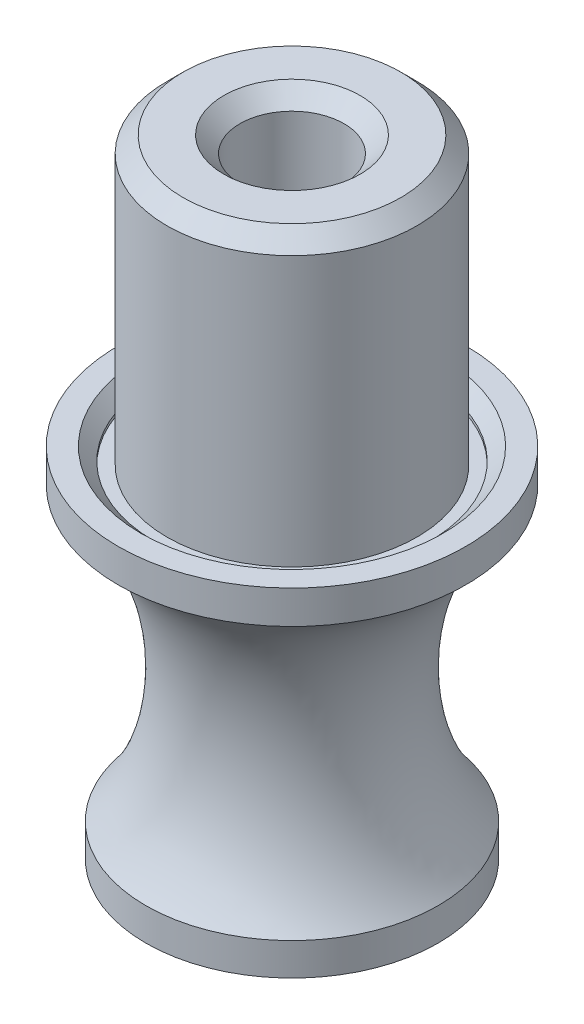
ISO-10303-21;
HEADER;
FILE_DESCRIPTION(('STEP AP214'),'2;1');
FILE_NAME('part.step','',(''),(''),'','','');
FILE_SCHEMA(('AUTOMOTIVE_DESIGN { 1 0 10303 214 1 1 1 1 }'));
ENDSEC;
DATA;
#1=APPLICATION_CONTEXT('core data for automotive mechanical design processes');
#2=APPLICATION_PROTOCOL_DEFINITION('international standard','automotive_design',2000,#1);
#3=PRODUCT_CONTEXT('',#1,'mechanical');
#4=PRODUCT('Part','Part','',(#3));
#5=PRODUCT_RELATED_PRODUCT_CATEGORY('part','',(#4));
#6=PRODUCT_DEFINITION_FORMATION('','',#4);
#7=PRODUCT_DEFINITION_CONTEXT('part definition',#1,'design');
#8=PRODUCT_DEFINITION('design','',#6,#7);
#9=PRODUCT_DEFINITION_SHAPE('','',#8);
#10=(LENGTH_UNIT() NAMED_UNIT(*) SI_UNIT(.MILLI.,.METRE.));
#11=(NAMED_UNIT(*) PLANE_ANGLE_UNIT() SI_UNIT($,.RADIAN.));
#12=(NAMED_UNIT(*) SI_UNIT($,.STERADIAN.) SOLID_ANGLE_UNIT());
#13=UNCERTAINTY_MEASURE_WITH_UNIT(LENGTH_MEASURE(1.E-05),#10,'distance_accuracy_value','');
#14=(GEOMETRIC_REPRESENTATION_CONTEXT(3) GLOBAL_UNCERTAINTY_ASSIGNED_CONTEXT((#13)) GLOBAL_UNIT_ASSIGNED_CONTEXT((#10,
#11,#12)) REPRESENTATION_CONTEXT('',''));
#15=CARTESIAN_POINT('',(0.,0.,0.));
#16=DIRECTION('',(0.,0.,1.));
#17=DIRECTION('',(1.,0.,0.));
#18=AXIS2_PLACEMENT_3D('',#15,#16,#17);
#19=CARTESIAN_POINT('',(3.85,10.5,0.));
#20=DIRECTION('',(0.,-1.,0.));
#21=DIRECTION('',(0.,0.,-1.));
#22=AXIS2_PLACEMENT_3D('',#19,#20,#21);
#23=PLANE('',#22);
#24=CARTESIAN_POINT('',(0.,10.5,0.));
#25=DIRECTION('',(0.,1.,0.));
#26=DIRECTION('',(0.,0.,1.));
#27=AXIS2_PLACEMENT_3D('',#24,#25,#26);
#28=CIRCLE('',#27,3.85);
#29=CARTESIAN_POINT('',(0.,10.5,3.85));
#30=VERTEX_POINT('',#29);
#31=EDGE_CURVE('E10',#30,#30,#28,.T.);
#32=ORIENTED_EDGE('',*,*,#31,.F.);
#33=EDGE_LOOP('',(#32));
#34=FACE_BOUND('',#33,.T.);
#35=CARTESIAN_POINT('',(0.,10.5,0.));
#36=DIRECTION('',(0.,1.,0.));
#37=DIRECTION('',(0.,0.,1.));
#38=AXIS2_PLACEMENT_3D('',#35,#36,#37);
#39=CIRCLE('',#38,4.25);
#40=CARTESIAN_POINT('',(0.,10.5,4.25));
#41=VERTEX_POINT('',#40);
#42=EDGE_CURVE('E36',#41,#41,#39,.T.);
#43=ORIENTED_EDGE('',*,*,#42,.T.);
#44=EDGE_LOOP('',(#43));
#45=FACE_BOUND('',#44,.T.);
#46=ADVANCED_FACE('F30',(#34,#45),#23,.F.);
#47=CARTESIAN_POINT('',(0.,41.6,0.));
#48=DIRECTION('',(0.,1.,0.));
#49=DIRECTION('',(0.,0.,1.));
#50=AXIS2_PLACEMENT_3D('',#47,#48,#49);
#51=CYLINDRICAL_SURFACE('',#50,4.25);
#52=ORIENTED_EDGE('',*,*,#42,.F.);
#53=EDGE_LOOP('',(#52));
#54=FACE_BOUND('',#53,.T.);
#55=CARTESIAN_POINT('',(0.,10.6,0.));
#56=DIRECTION('',(0.,1.,0.));
#57=DIRECTION('',(0.,0.,1.));
#58=AXIS2_PLACEMENT_3D('',#55,#56,#57);
#59=CIRCLE('',#58,4.25);
#60=CARTESIAN_POINT('',(0.,10.6,4.25));
#61=VERTEX_POINT('',#60);
#62=EDGE_CURVE('E40',#61,#61,#59,.T.);
#63=ORIENTED_EDGE('',*,*,#62,.T.);
#64=EDGE_LOOP('',(#63));
#65=FACE_BOUND('',#64,.T.);
#66=ADVANCED_FACE('F103',(#54,#65),#51,.F.);
#67=CARTESIAN_POINT('',(0.,11.,0.));
#68=DIRECTION('',(0.,1.,0.));
#69=DIRECTION('',(0.,0.,1.));
#70=AXIS2_PLACEMENT_3D('',#67,#68,#69);
#71=CONICAL_SURFACE('',#70,4.65,0.785398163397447);
#72=ORIENTED_EDGE('',*,*,#62,.F.);
#73=EDGE_LOOP('',(#72));
#74=FACE_BOUND('',#73,.T.);
#75=CARTESIAN_POINT('',(0.,11.,0.));
#76=DIRECTION('',(0.,1.,0.));
#77=DIRECTION('',(0.,0.,1.));
#78=AXIS2_PLACEMENT_3D('',#75,#76,#77);
#79=CIRCLE('',#78,4.65);
#80=CARTESIAN_POINT('',(0.,11.,4.65));
#81=VERTEX_POINT('',#80);
#82=EDGE_CURVE('E44',#81,#81,#79,.T.);
#83=ORIENTED_EDGE('',*,*,#82,.T.);
#84=EDGE_LOOP('',(#83));
#85=FACE_BOUND('',#84,.T.);
#86=ADVANCED_FACE('F100',(#74,#85),#71,.F.);
#87=CARTESIAN_POINT('',(4.65,11.,0.));
#88=DIRECTION('',(0.,-1.,0.));
#89=DIRECTION('',(0.,0.,-1.));
#90=AXIS2_PLACEMENT_3D('',#87,#88,#89);
#91=PLANE('',#90);
#92=ORIENTED_EDGE('',*,*,#82,.F.);
#93=EDGE_LOOP('',(#92));
#94=FACE_BOUND('',#93,.T.);
#95=CARTESIAN_POINT('',(0.,11.,0.));
#96=DIRECTION('',(0.,1.,0.));
#97=DIRECTION('',(0.,0.,1.));
#98=AXIS2_PLACEMENT_3D('',#95,#96,#97);
#99=CIRCLE('',#98,5.35);
#100=CARTESIAN_POINT('',(0.,11.,5.35));
#101=VERTEX_POINT('',#100);
#102=EDGE_CURVE('E49',#101,#101,#99,.T.);
#103=ORIENTED_EDGE('',*,*,#102,.T.);
#104=EDGE_LOOP('',(#103));
#105=FACE_BOUND('',#104,.T.);
#106=ADVANCED_FACE('F96',(#94,#105),#91,.F.);
#107=CARTESIAN_POINT('',(0.,41.6,0.));
#108=DIRECTION('',(0.,1.,0.));
#109=DIRECTION('',(0.,0.,1.));
#110=AXIS2_PLACEMENT_3D('',#107,#108,#109);
#111=CYLINDRICAL_SURFACE('',#110,5.35);
#112=ORIENTED_EDGE('',*,*,#102,.F.);
#113=EDGE_LOOP('',(#112));
#114=FACE_BOUND('',#113,.T.);
#115=CARTESIAN_POINT('',(0.,9.97483450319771,0.));
#116=DIRECTION('',(0.,1.,0.));
#117=DIRECTION('',(0.,0.,1.));
#118=AXIS2_PLACEMENT_3D('',#115,#116,#117);
#119=CIRCLE('',#118,5.35);
#120=CARTESIAN_POINT('',(0.,9.97483450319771,5.35));
#121=VERTEX_POINT('',#120);
#122=EDGE_CURVE('E52',#121,#121,#119,.T.);
#123=ORIENTED_EDGE('',*,*,#122,.T.);
#124=EDGE_LOOP('',(#123));
#125=FACE_BOUND('',#124,.T.);
#126=ADVANCED_FACE('F91',(#114,#125),#111,.T.);
#127=CARTESIAN_POINT('',(4.50000000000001,0.999999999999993,0.));
#128=CARTESIAN_POINT('',(2.25123785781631,3.73897166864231,0.));
#129=CARTESIAN_POINT('',(3.12107677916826,8.91085582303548,0.));
#130=CARTESIAN_POINT('',(5.35,9.97483450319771,0.));
#131=B_SPLINE_CURVE_WITH_KNOTS('',3,(#127,#128,#129,#130),.UNSPECIFIED.,.F.,.F.,(4,4),(0.,1.),.UNSPECIFIED.);
#132=CARTESIAN_POINT('',(0.,41.6,0.));
#133=DIRECTION('',(0.,1.,0.));
#134=AXIS1_PLACEMENT('',#132,#133);
#135=SURFACE_OF_REVOLUTION('',#131,#134);
#136=ORIENTED_EDGE('',*,*,#122,.F.);
#137=EDGE_LOOP('',(#136));
#138=FACE_BOUND('',#137,.T.);
#139=CARTESIAN_POINT('',(0.,1.,0.));
#140=DIRECTION('',(0.,1.,0.));
#141=DIRECTION('',(0.,0.,1.));
#142=AXIS2_PLACEMENT_3D('',#139,#140,#141);
#143=CIRCLE('',#142,4.5);
#144=CARTESIAN_POINT('',(0.,1.,4.5));
#145=VERTEX_POINT('',#144);
#146=EDGE_CURVE('E55',#145,#145,#143,.T.);
#147=ORIENTED_EDGE('',*,*,#146,.T.);
#148=EDGE_LOOP('',(#147));
#149=FACE_BOUND('',#148,.T.);
#150=ADVANCED_FACE('F86',(#138,#149),#135,.T.);
#151=CARTESIAN_POINT('',(0.,41.6,0.));
#152=DIRECTION('',(0.,1.,0.));
#153=DIRECTION('',(0.,0.,1.));
#154=AXIS2_PLACEMENT_3D('',#151,#152,#153);
#155=CYLINDRICAL_SURFACE('',#154,4.5);
#156=ORIENTED_EDGE('',*,*,#146,.F.);
#157=EDGE_LOOP('',(#156));
#158=FACE_BOUND('',#157,.T.);
#159=CARTESIAN_POINT('',(0.,0.,0.));
#160=DIRECTION('',(0.,1.,0.));
#161=DIRECTION('',(0.,0.,1.));
#162=AXIS2_PLACEMENT_3D('',#159,#160,#161);
#163=CIRCLE('',#162,4.5);
#164=CARTESIAN_POINT('',(0.,0.,4.5));
#165=VERTEX_POINT('',#164);
#166=EDGE_CURVE('E58',#165,#165,#163,.T.);
#167=ORIENTED_EDGE('',*,*,#166,.T.);
#168=EDGE_LOOP('',(#167));
#169=FACE_BOUND('',#168,.T.);
#170=ADVANCED_FACE('F90',(#158,#169),#155,.T.);
#171=CARTESIAN_POINT('',(2.1,0.,0.));
#172=DIRECTION('',(0.,1.,0.));
#173=DIRECTION('',(0.,0.,1.));
#174=AXIS2_PLACEMENT_3D('',#171,#172,#173);
#175=PLANE('',#174);
#176=ORIENTED_EDGE('',*,*,#166,.F.);
#177=EDGE_LOOP('',(#176));
#178=FACE_BOUND('',#177,.T.);
#179=CARTESIAN_POINT('',(0.,0.,0.));
#180=DIRECTION('',(0.,1.,0.));
#181=DIRECTION('',(0.,0.,1.));
#182=AXIS2_PLACEMENT_3D('',#179,#180,#181);
#183=CIRCLE('',#182,2.1);
#184=CARTESIAN_POINT('',(0.,0.,2.1));
#185=VERTEX_POINT('',#184);
#186=EDGE_CURVE('E61',#185,#185,#183,.T.);
#187=ORIENTED_EDGE('',*,*,#186,.T.);
#188=EDGE_LOOP('',(#187));
#189=FACE_BOUND('',#188,.T.);
#190=ADVANCED_FACE('F124',(#178,#189),#175,.F.);
#191=CARTESIAN_POINT('',(0.,0.5,0.));
#192=DIRECTION('',(0.,-1.,0.));
#193=DIRECTION('',(0.,0.,-1.));
#194=AXIS2_PLACEMENT_3D('',#191,#192,#193);
#195=CONICAL_SURFACE('',#194,1.6,0.785398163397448);
#196=ORIENTED_EDGE('',*,*,#186,.F.);
#197=EDGE_LOOP('',(#196));
#198=FACE_BOUND('',#197,.T.);
#199=CARTESIAN_POINT('',(0.,0.5,0.));
#200=DIRECTION('',(0.,1.,0.));
#201=DIRECTION('',(0.,0.,1.));
#202=AXIS2_PLACEMENT_3D('',#199,#200,#201);
#203=CIRCLE('',#202,1.6);
#204=CARTESIAN_POINT('',(0.,0.5,1.6));
#205=VERTEX_POINT('',#204);
#206=EDGE_CURVE('E64',#205,#205,#203,.T.);
#207=ORIENTED_EDGE('',*,*,#206,.T.);
#208=EDGE_LOOP('',(#207));
#209=FACE_BOUND('',#208,.T.);
#210=ADVANCED_FACE('F129',(#198,#209),#195,.F.);
#211=CARTESIAN_POINT('',(0.,41.6,0.));
#212=DIRECTION('',(0.,1.,0.));
#213=DIRECTION('',(0.,0.,1.));
#214=AXIS2_PLACEMENT_3D('',#211,#212,#213);
#215=CYLINDRICAL_SURFACE('',#214,1.6);
#216=ORIENTED_EDGE('',*,*,#206,.F.);
#217=EDGE_LOOP('',(#216));
#218=FACE_BOUND('',#217,.T.);
#219=CARTESIAN_POINT('',(0.,18.8,0.));
#220=DIRECTION('',(0.,1.,0.));
#221=DIRECTION('',(0.,0.,1.));
#222=AXIS2_PLACEMENT_3D('',#219,#220,#221);
#223=CIRCLE('',#222,1.6);
#224=CARTESIAN_POINT('',(0.,18.8,1.6));
#225=VERTEX_POINT('',#224);
#226=EDGE_CURVE('E67',#225,#225,#223,.T.);
#227=ORIENTED_EDGE('',*,*,#226,.T.);
#228=EDGE_LOOP('',(#227));
#229=FACE_BOUND('',#228,.T.);
#230=ADVANCED_FACE('F134',(#218,#229),#215,.F.);
#231=CARTESIAN_POINT('',(0.,19.3,0.));
#232=DIRECTION('',(0.,1.,0.));
#233=DIRECTION('',(0.,0.,1.));
#234=AXIS2_PLACEMENT_3D('',#231,#232,#233);
#235=CONICAL_SURFACE('',#234,2.1,0.785398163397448);
#236=ORIENTED_EDGE('',*,*,#226,.F.);
#237=EDGE_LOOP('',(#236));
#238=FACE_BOUND('',#237,.T.);
#239=CARTESIAN_POINT('',(0.,19.3,0.));
#240=DIRECTION('',(0.,1.,0.));
#241=DIRECTION('',(0.,0.,1.));
#242=AXIS2_PLACEMENT_3D('',#239,#240,#241);
#243=CIRCLE('',#242,2.1);
#244=CARTESIAN_POINT('',(0.,19.3,2.1));
#245=VERTEX_POINT('',#244);
#246=EDGE_CURVE('E70',#245,#245,#243,.T.);
#247=ORIENTED_EDGE('',*,*,#246,.T.);
#248=EDGE_LOOP('',(#247));
#249=FACE_BOUND('',#248,.T.);
#250=ADVANCED_FACE('F140',(#238,#249),#235,.F.);
#251=CARTESIAN_POINT('',(2.1,19.3,0.));
#252=DIRECTION('',(0.,-1.,0.));
#253=DIRECTION('',(0.,0.,-1.));
#254=AXIS2_PLACEMENT_3D('',#251,#252,#253);
#255=PLANE('',#254);
#256=ORIENTED_EDGE('',*,*,#246,.F.);
#257=EDGE_LOOP('',(#256));
#258=FACE_BOUND('',#257,.T.);
#259=CARTESIAN_POINT('',(0.,19.3,0.));
#260=DIRECTION('',(0.,1.,0.));
#261=DIRECTION('',(0.,0.,1.));
#262=AXIS2_PLACEMENT_3D('',#259,#260,#261);
#263=CIRCLE('',#262,3.35);
#264=CARTESIAN_POINT('',(0.,19.3,3.35));
#265=VERTEX_POINT('',#264);
#266=EDGE_CURVE('E73',#265,#265,#263,.T.);
#267=ORIENTED_EDGE('',*,*,#266,.T.);
#268=EDGE_LOOP('',(#267));
#269=FACE_BOUND('',#268,.T.);
#270=ADVANCED_FACE('F146',(#258,#269),#255,.F.);
#271=CARTESIAN_POINT('',(0.,18.8,0.));
#272=DIRECTION('',(0.,-1.,0.));
#273=DIRECTION('',(0.,0.,-1.));
#274=AXIS2_PLACEMENT_3D('',#271,#272,#273);
#275=CONICAL_SURFACE('',#274,3.85,0.785398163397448);
#276=ORIENTED_EDGE('',*,*,#266,.F.);
#277=EDGE_LOOP('',(#276));
#278=FACE_BOUND('',#277,.T.);
#279=CARTESIAN_POINT('',(0.,18.8,0.));
#280=DIRECTION('',(0.,1.,0.));
#281=DIRECTION('',(0.,0.,1.));
#282=AXIS2_PLACEMENT_3D('',#279,#280,#281);
#283=CIRCLE('',#282,3.85);
#284=CARTESIAN_POINT('',(0.,18.8,3.85));
#285=VERTEX_POINT('',#284);
#286=EDGE_CURVE('E76',#285,#285,#283,.T.);
#287=ORIENTED_EDGE('',*,*,#286,.T.);
#288=EDGE_LOOP('',(#287));
#289=FACE_BOUND('',#288,.T.);
#290=ADVANCED_FACE('F152',(#278,#289),#275,.T.);
#291=CARTESIAN_POINT('',(0.,41.6,0.));
#292=DIRECTION('',(0.,1.,0.));
#293=DIRECTION('',(0.,0.,1.));
#294=AXIS2_PLACEMENT_3D('',#291,#292,#293);
#295=CYLINDRICAL_SURFACE('',#294,3.85);
#296=ORIENTED_EDGE('',*,*,#286,.F.);
#297=EDGE_LOOP('',(#296));
#298=FACE_BOUND('',#297,.T.);
#299=ORIENTED_EDGE('',*,*,#31,.T.);
#300=EDGE_LOOP('',(#299));
#301=FACE_BOUND('',#300,.T.);
#302=ADVANCED_FACE('F158',(#298,#301),#295,.T.);
#303=CLOSED_SHELL('',(#46,#66,#86,#106,#126,#150,#170,#190,#210,#230,#250,#270,#290,#302));
#304=MANIFOLD_SOLID_BREP('B2',#303);
#305=ADVANCED_BREP_SHAPE_REPRESENTATION('',(#18,#304),#14);
#306=SHAPE_DEFINITION_REPRESENTATION(#9,#305);
ENDSEC;
END-ISO-10303-21;
